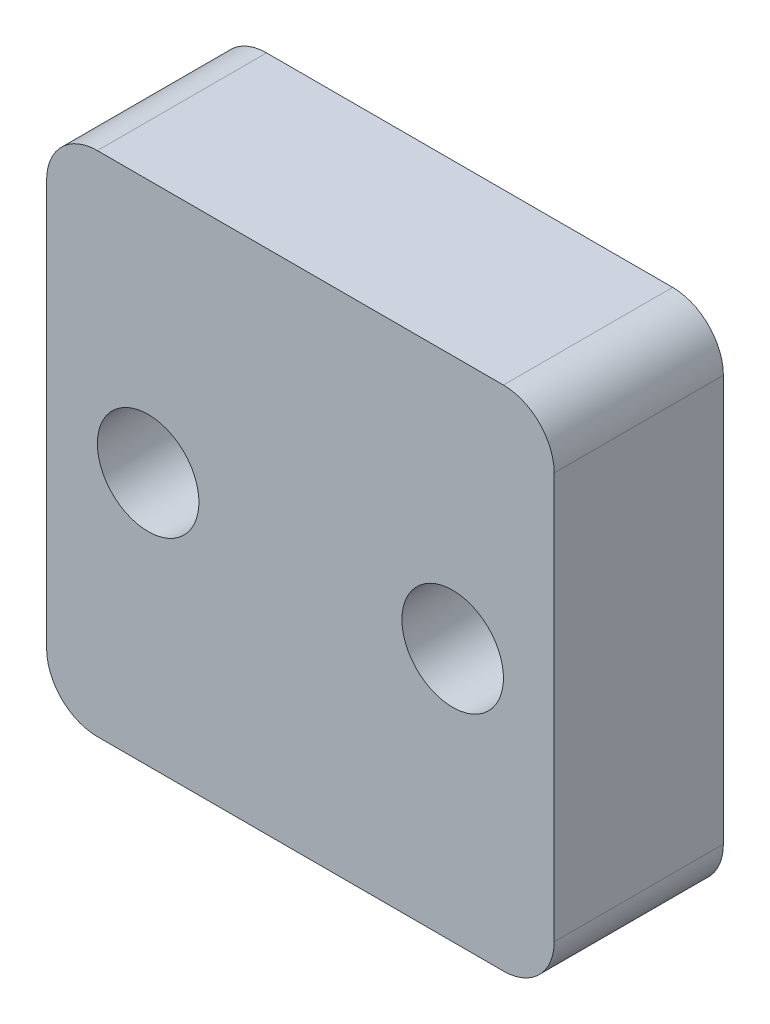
ISO-10303-21;
HEADER;
FILE_DESCRIPTION(('STEP AP214'),'2;1');
FILE_NAME('part.step','',(''),(''),'','','');
FILE_SCHEMA(('AUTOMOTIVE_DESIGN { 1 0 10303 214 1 1 1 1 }'));
ENDSEC;
DATA;
#1=APPLICATION_CONTEXT('core data for automotive mechanical design processes');
#2=APPLICATION_PROTOCOL_DEFINITION('international standard','automotive_design',2000,#1);
#3=PRODUCT_CONTEXT('',#1,'mechanical');
#4=PRODUCT('Part','Part','',(#3));
#5=PRODUCT_RELATED_PRODUCT_CATEGORY('part','',(#4));
#6=PRODUCT_DEFINITION_FORMATION('','',#4);
#7=PRODUCT_DEFINITION_CONTEXT('part definition',#1,'design');
#8=PRODUCT_DEFINITION('design','',#6,#7);
#9=PRODUCT_DEFINITION_SHAPE('','',#8);
#10=(LENGTH_UNIT() NAMED_UNIT(*) SI_UNIT(.MILLI.,.METRE.));
#11=(NAMED_UNIT(*) PLANE_ANGLE_UNIT() SI_UNIT($,.RADIAN.));
#12=(NAMED_UNIT(*) SI_UNIT($,.STERADIAN.) SOLID_ANGLE_UNIT());
#13=UNCERTAINTY_MEASURE_WITH_UNIT(LENGTH_MEASURE(1.E-05),#10,'distance_accuracy_value','');
#14=(GEOMETRIC_REPRESENTATION_CONTEXT(3) GLOBAL_UNCERTAINTY_ASSIGNED_CONTEXT((#13)) GLOBAL_UNIT_ASSIGNED_CONTEXT((#10,
#11,#12)) REPRESENTATION_CONTEXT('',''));
#15=CARTESIAN_POINT('',(0.,0.,0.));
#16=DIRECTION('',(0.,0.,1.));
#17=DIRECTION('',(1.,0.,0.));
#18=AXIS2_PLACEMENT_3D('',#15,#16,#17);
#19=CARTESIAN_POINT('',(-15.,-15.,0.));
#20=DIRECTION('',(0.,0.,1.));
#21=DIRECTION('',(1.,0.,0.));
#22=AXIS2_PLACEMENT_3D('',#19,#20,#21);
#23=PLANE('',#22);
#24=CARTESIAN_POINT('',(9.00000000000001,0.,0.));
#25=DIRECTION('',(0.,0.,-1.));
#26=DIRECTION('',(-1.,0.,0.));
#27=AXIS2_PLACEMENT_3D('',#24,#25,#26);
#28=CIRCLE('',#27,3.);
#29=CARTESIAN_POINT('',(6.,0.,0.));
#30=VERTEX_POINT('',#29);
#31=EDGE_CURVE('E134',#30,#30,#28,.F.);
#32=ORIENTED_EDGE('',*,*,#31,.T.);
#33=EDGE_LOOP('',(#32));
#34=FACE_BOUND('',#33,.T.);
#35=CARTESIAN_POINT('',(12.,12.,0.));
#36=DIRECTION('',(0.,0.,-1.));
#37=DIRECTION('',(-1.,0.,0.));
#38=AXIS2_PLACEMENT_3D('',#35,#36,#37);
#39=CIRCLE('',#38,3.);
#40=CARTESIAN_POINT('',(15.,12.,0.));
#41=VERTEX_POINT('',#40);
#42=CARTESIAN_POINT('',(12.,15.,0.));
#43=VERTEX_POINT('',#42);
#44=EDGE_CURVE('E85',#41,#43,#39,.F.);
#45=ORIENTED_EDGE('',*,*,#44,.F.);
#46=DIRECTION('',(0.,-1.,0.));
#47=VECTOR('',#46,1.);
#48=CARTESIAN_POINT('',(15.,15.,0.));
#49=LINE('',#48,#47);
#50=CARTESIAN_POINT('',(15.,-12.,0.));
#51=VERTEX_POINT('',#50);
#52=EDGE_CURVE('E77',#41,#51,#49,.T.);
#53=ORIENTED_EDGE('',*,*,#52,.T.);
#54=CARTESIAN_POINT('',(12.,-12.,0.));
#55=DIRECTION('',(0.,0.,-1.));
#56=DIRECTION('',(-1.,0.,0.));
#57=AXIS2_PLACEMENT_3D('',#54,#55,#56);
#58=CIRCLE('',#57,3.);
#59=CARTESIAN_POINT('',(12.,-15.,0.));
#60=VERTEX_POINT('',#59);
#61=EDGE_CURVE('E138',#60,#51,#58,.F.);
#62=ORIENTED_EDGE('',*,*,#61,.F.);
#63=DIRECTION('',(-1.,0.,0.));
#64=VECTOR('',#63,1.);
#65=CARTESIAN_POINT('',(-15.,-15.,0.));
#66=LINE('',#65,#64);
#67=CARTESIAN_POINT('',(-12.,-15.,0.));
#68=VERTEX_POINT('',#67);
#69=EDGE_CURVE('E110',#60,#68,#66,.T.);
#70=ORIENTED_EDGE('',*,*,#69,.T.);
#71=CARTESIAN_POINT('',(-12.,-12.,0.));
#72=DIRECTION('',(0.,0.,-1.));
#73=DIRECTION('',(-1.,0.,0.));
#74=AXIS2_PLACEMENT_3D('',#71,#72,#73);
#75=CIRCLE('',#74,3.);
#76=CARTESIAN_POINT('',(-15.,-12.,0.));
#77=VERTEX_POINT('',#76);
#78=EDGE_CURVE('E141',#77,#68,#75,.F.);
#79=ORIENTED_EDGE('',*,*,#78,.F.);
#80=DIRECTION('',(0.,1.,0.));
#81=VECTOR('',#80,1.);
#82=CARTESIAN_POINT('',(-15.,15.,0.));
#83=LINE('',#82,#81);
#84=CARTESIAN_POINT('',(-15.,12.,0.));
#85=VERTEX_POINT('',#84);
#86=EDGE_CURVE('E114',#77,#85,#83,.T.);
#87=ORIENTED_EDGE('',*,*,#86,.T.);
#88=CARTESIAN_POINT('',(-12.,12.,0.));
#89=DIRECTION('',(0.,0.,-1.));
#90=DIRECTION('',(-1.,0.,0.));
#91=AXIS2_PLACEMENT_3D('',#88,#89,#90);
#92=CIRCLE('',#91,3.);
#93=CARTESIAN_POINT('',(-12.,15.,0.));
#94=VERTEX_POINT('',#93);
#95=EDGE_CURVE('E88',#94,#85,#92,.F.);
#96=ORIENTED_EDGE('',*,*,#95,.F.);
#97=DIRECTION('',(1.,0.,0.));
#98=VECTOR('',#97,1.);
#99=CARTESIAN_POINT('',(-15.,15.,0.));
#100=LINE('',#99,#98);
#101=EDGE_CURVE('E82',#94,#43,#100,.T.);
#102=ORIENTED_EDGE('',*,*,#101,.T.);
#103=EDGE_LOOP('',(#45,#53,#62,#70,#79,#87,#96,#102));
#104=FACE_BOUND('',#103,.T.);
#105=CARTESIAN_POINT('',(-8.99999999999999,0.,0.));
#106=DIRECTION('',(0.,0.,-1.));
#107=DIRECTION('',(-1.,0.,0.));
#108=AXIS2_PLACEMENT_3D('',#105,#106,#107);
#109=CIRCLE('',#108,3.);
#110=CARTESIAN_POINT('',(-12.,0.,0.));
#111=VERTEX_POINT('',#110);
#112=EDGE_CURVE('E19',#111,#111,#109,.F.);
#113=ORIENTED_EDGE('',*,*,#112,.T.);
#114=EDGE_LOOP('',(#113));
#115=FACE_BOUND('',#114,.T.);
#116=ADVANCED_FACE('F16',(#34,#104,#115),#23,.F.);
#117=CARTESIAN_POINT('',(-8.99999999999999,0.,10.));
#118=DIRECTION('',(0.,0.,-1.));
#119=DIRECTION('',(-1.,0.,0.));
#120=AXIS2_PLACEMENT_3D('',#117,#118,#119);
#121=CYLINDRICAL_SURFACE('',#120,3.);
#122=CARTESIAN_POINT('',(-8.99999999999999,0.,10.));
#123=DIRECTION('',(0.,0.,-1.));
#124=DIRECTION('',(-1.,0.,0.));
#125=AXIS2_PLACEMENT_3D('',#122,#123,#124);
#126=CIRCLE('',#125,3.);
#127=CARTESIAN_POINT('',(-12.,0.,10.));
#128=VERTEX_POINT('',#127);
#129=EDGE_CURVE('E131',#128,#128,#126,.T.);
#130=ORIENTED_EDGE('',*,*,#129,.F.);
#131=EDGE_LOOP('',(#130));
#132=FACE_BOUND('',#131,.T.);
#133=ORIENTED_EDGE('',*,*,#112,.F.);
#134=EDGE_LOOP('',(#133));
#135=FACE_BOUND('',#134,.T.);
#136=ADVANCED_FACE('F263',(#132,#135),#121,.F.);
#137=CARTESIAN_POINT('',(15.,15.,10.));
#138=DIRECTION('',(-1.,0.,0.));
#139=DIRECTION('',(0.,-1.,0.));
#140=AXIS2_PLACEMENT_3D('',#137,#138,#139);
#141=PLANE('',#140);
#142=DIRECTION('',(0.,0.,-1.));
#143=VECTOR('',#142,1.);
#144=CARTESIAN_POINT('',(15.,12.,10.));
#145=LINE('',#144,#143);
#146=CARTESIAN_POINT('',(15.,12.,10.));
#147=VERTEX_POINT('',#146);
#148=EDGE_CURVE('E98',#147,#41,#145,.T.);
#149=ORIENTED_EDGE('',*,*,#148,.F.);
#150=DIRECTION('',(0.,1.,0.));
#151=VECTOR('',#150,1.);
#152=CARTESIAN_POINT('',(15.,-15.,10.));
#153=LINE('',#152,#151);
#154=CARTESIAN_POINT('',(15.,-12.,10.));
#155=VERTEX_POINT('',#154);
#156=EDGE_CURVE('E130',#155,#147,#153,.T.);
#157=ORIENTED_EDGE('',*,*,#156,.F.);
#158=DIRECTION('',(0.,0.,-1.));
#159=VECTOR('',#158,1.);
#160=CARTESIAN_POINT('',(15.,-12.,10.));
#161=LINE('',#160,#159);
#162=EDGE_CURVE('E137',#51,#155,#161,.F.);
#163=ORIENTED_EDGE('',*,*,#162,.F.);
#164=ORIENTED_EDGE('',*,*,#52,.F.);
#165=EDGE_LOOP('',(#149,#157,#163,#164));
#166=FACE_BOUND('',#165,.T.);
#167=ADVANCED_FACE('F172',(#166),#141,.F.);
#168=CARTESIAN_POINT('',(12.,12.,10.));
#169=DIRECTION('',(0.,0.,-1.));
#170=DIRECTION('',(-1.,0.,0.));
#171=AXIS2_PLACEMENT_3D('',#168,#169,#170);
#172=CYLINDRICAL_SURFACE('',#171,3.);
#173=ORIENTED_EDGE('',*,*,#44,.T.);
#174=DIRECTION('',(0.,0.,1.));
#175=VECTOR('',#174,1.);
#176=CARTESIAN_POINT('',(12.,15.,10.));
#177=LINE('',#176,#175);
#178=CARTESIAN_POINT('',(12.,15.,10.));
#179=VERTEX_POINT('',#178);
#180=EDGE_CURVE('E92',#43,#179,#177,.T.);
#181=ORIENTED_EDGE('',*,*,#180,.T.);
#182=CARTESIAN_POINT('',(12.,12.,10.));
#183=DIRECTION('',(0.,0.,-1.));
#184=DIRECTION('',(-1.,0.,0.));
#185=AXIS2_PLACEMENT_3D('',#182,#183,#184);
#186=CIRCLE('',#185,3.);
#187=EDGE_CURVE('E128',#147,#179,#186,.F.);
#188=ORIENTED_EDGE('',*,*,#187,.F.);
#189=ORIENTED_EDGE('',*,*,#148,.T.);
#190=EDGE_LOOP('',(#173,#181,#188,#189));
#191=FACE_BOUND('',#190,.T.);
#192=ADVANCED_FACE('F95',(#191),#172,.T.);
#193=CARTESIAN_POINT('',(-15.,15.,10.));
#194=DIRECTION('',(0.,-1.,0.));
#195=DIRECTION('',(1.,0.,0.));
#196=AXIS2_PLACEMENT_3D('',#193,#194,#195);
#197=PLANE('',#196);
#198=ORIENTED_EDGE('',*,*,#180,.F.);
#199=ORIENTED_EDGE('',*,*,#101,.F.);
#200=DIRECTION('',(0.,0.,-1.));
#201=VECTOR('',#200,1.);
#202=CARTESIAN_POINT('',(-12.,15.,10.));
#203=LINE('',#202,#201);
#204=CARTESIAN_POINT('',(-12.,15.,10.));
#205=VERTEX_POINT('',#204);
#206=EDGE_CURVE('E103',#205,#94,#203,.T.);
#207=ORIENTED_EDGE('',*,*,#206,.F.);
#208=DIRECTION('',(1.,0.,0.));
#209=VECTOR('',#208,1.);
#210=CARTESIAN_POINT('',(-15.,15.,10.));
#211=LINE('',#210,#209);
#212=EDGE_CURVE('E101',#179,#205,#211,.F.);
#213=ORIENTED_EDGE('',*,*,#212,.F.);
#214=EDGE_LOOP('',(#198,#199,#207,#213));
#215=FACE_BOUND('',#214,.T.);
#216=ADVANCED_FACE('F99',(#215),#197,.F.);
#217=CARTESIAN_POINT('',(-12.,12.,10.));
#218=DIRECTION('',(0.,0.,-1.));
#219=DIRECTION('',(-1.,0.,0.));
#220=AXIS2_PLACEMENT_3D('',#217,#218,#219);
#221=CYLINDRICAL_SURFACE('',#220,3.);
#222=ORIENTED_EDGE('',*,*,#95,.T.);
#223=DIRECTION('',(0.,0.,1.));
#224=VECTOR('',#223,1.);
#225=CARTESIAN_POINT('',(-15.,12.,10.));
#226=LINE('',#225,#224);
#227=CARTESIAN_POINT('',(-15.,12.,10.));
#228=VERTEX_POINT('',#227);
#229=EDGE_CURVE('E116',#85,#228,#226,.T.);
#230=ORIENTED_EDGE('',*,*,#229,.T.);
#231=CARTESIAN_POINT('',(-12.,12.,10.));
#232=DIRECTION('',(0.,0.,-1.));
#233=DIRECTION('',(-1.,0.,0.));
#234=AXIS2_PLACEMENT_3D('',#231,#232,#233);
#235=CIRCLE('',#234,3.);
#236=EDGE_CURVE('E125',#205,#228,#235,.F.);
#237=ORIENTED_EDGE('',*,*,#236,.F.);
#238=ORIENTED_EDGE('',*,*,#206,.T.);
#239=EDGE_LOOP('',(#222,#230,#237,#238));
#240=FACE_BOUND('',#239,.T.);
#241=ADVANCED_FACE('F173',(#240),#221,.T.);
#242=CARTESIAN_POINT('',(-15.,15.,10.));
#243=DIRECTION('',(1.,0.,0.));
#244=DIRECTION('',(0.,1.,0.));
#245=AXIS2_PLACEMENT_3D('',#242,#243,#244);
#246=PLANE('',#245);
#247=DIRECTION('',(0.,0.,-1.));
#248=VECTOR('',#247,1.);
#249=CARTESIAN_POINT('',(-15.,-12.,10.));
#250=LINE('',#249,#248);
#251=CARTESIAN_POINT('',(-15.,-12.,10.));
#252=VERTEX_POINT('',#251);
#253=EDGE_CURVE('E115',#252,#77,#250,.T.);
#254=ORIENTED_EDGE('',*,*,#253,.F.);
#255=DIRECTION('',(0.,1.,0.));
#256=VECTOR('',#255,1.);
#257=CARTESIAN_POINT('',(-15.,-15.,10.));
#258=LINE('',#257,#256);
#259=EDGE_CURVE('E124',#228,#252,#258,.F.);
#260=ORIENTED_EDGE('',*,*,#259,.F.);
#261=ORIENTED_EDGE('',*,*,#229,.F.);
#262=ORIENTED_EDGE('',*,*,#86,.F.);
#263=EDGE_LOOP('',(#254,#260,#261,#262));
#264=FACE_BOUND('',#263,.T.);
#265=ADVANCED_FACE('F175',(#264),#246,.F.);
#266=CARTESIAN_POINT('',(-12.,-12.,10.));
#267=DIRECTION('',(0.,0.,-1.));
#268=DIRECTION('',(-1.,0.,0.));
#269=AXIS2_PLACEMENT_3D('',#266,#267,#268);
#270=CYLINDRICAL_SURFACE('',#269,3.);
#271=ORIENTED_EDGE('',*,*,#78,.T.);
#272=DIRECTION('',(0.,0.,1.));
#273=VECTOR('',#272,1.);
#274=CARTESIAN_POINT('',(-12.,-15.,10.));
#275=LINE('',#274,#273);
#276=CARTESIAN_POINT('',(-12.,-15.,10.));
#277=VERTEX_POINT('',#276);
#278=EDGE_CURVE('E113',#68,#277,#275,.T.);
#279=ORIENTED_EDGE('',*,*,#278,.T.);
#280=CARTESIAN_POINT('',(-12.,-12.,10.));
#281=DIRECTION('',(0.,0.,-1.));
#282=DIRECTION('',(-1.,0.,0.));
#283=AXIS2_PLACEMENT_3D('',#280,#281,#282);
#284=CIRCLE('',#283,3.);
#285=EDGE_CURVE('E121',#252,#277,#284,.F.);
#286=ORIENTED_EDGE('',*,*,#285,.F.);
#287=ORIENTED_EDGE('',*,*,#253,.T.);
#288=EDGE_LOOP('',(#271,#279,#286,#287));
#289=FACE_BOUND('',#288,.T.);
#290=ADVANCED_FACE('F168',(#289),#270,.T.);
#291=CARTESIAN_POINT('',(-15.,-15.,10.));
#292=DIRECTION('',(0.,1.,0.));
#293=DIRECTION('',(-1.,0.,0.));
#294=AXIS2_PLACEMENT_3D('',#291,#292,#293);
#295=PLANE('',#294);
#296=DIRECTION('',(0.,0.,-1.));
#297=VECTOR('',#296,1.);
#298=CARTESIAN_POINT('',(12.,-15.,10.));
#299=LINE('',#298,#297);
#300=CARTESIAN_POINT('',(12.,-15.,10.));
#301=VERTEX_POINT('',#300);
#302=EDGE_CURVE('E34',#301,#60,#299,.T.);
#303=ORIENTED_EDGE('',*,*,#302,.F.);
#304=DIRECTION('',(1.,0.,0.));
#305=VECTOR('',#304,1.);
#306=CARTESIAN_POINT('',(-15.,-15.,10.));
#307=LINE('',#306,#305);
#308=EDGE_CURVE('E120',#277,#301,#307,.T.);
#309=ORIENTED_EDGE('',*,*,#308,.F.);
#310=ORIENTED_EDGE('',*,*,#278,.F.);
#311=ORIENTED_EDGE('',*,*,#69,.F.);
#312=EDGE_LOOP('',(#303,#309,#310,#311));
#313=FACE_BOUND('',#312,.T.);
#314=ADVANCED_FACE('F165',(#313),#295,.F.);
#315=CARTESIAN_POINT('',(12.,-12.,10.));
#316=DIRECTION('',(0.,0.,-1.));
#317=DIRECTION('',(-1.,0.,0.));
#318=AXIS2_PLACEMENT_3D('',#315,#316,#317);
#319=CYLINDRICAL_SURFACE('',#318,3.);
#320=ORIENTED_EDGE('',*,*,#61,.T.);
#321=ORIENTED_EDGE('',*,*,#162,.T.);
#322=CARTESIAN_POINT('',(12.,-12.,10.));
#323=DIRECTION('',(0.,0.,-1.));
#324=DIRECTION('',(-1.,0.,0.));
#325=AXIS2_PLACEMENT_3D('',#322,#323,#324);
#326=CIRCLE('',#325,3.);
#327=EDGE_CURVE('E25',#301,#155,#326,.F.);
#328=ORIENTED_EDGE('',*,*,#327,.F.);
#329=ORIENTED_EDGE('',*,*,#302,.T.);
#330=EDGE_LOOP('',(#320,#321,#328,#329));
#331=FACE_BOUND('',#330,.T.);
#332=ADVANCED_FACE('F171',(#331),#319,.T.);
#333=CARTESIAN_POINT('',(9.00000000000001,0.,10.));
#334=DIRECTION('',(0.,0.,-1.));
#335=DIRECTION('',(-1.,0.,0.));
#336=AXIS2_PLACEMENT_3D('',#333,#334,#335);
#337=CYLINDRICAL_SURFACE('',#336,3.);
#338=CARTESIAN_POINT('',(9.00000000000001,0.,10.));
#339=DIRECTION('',(0.,0.,-1.));
#340=DIRECTION('',(-1.,0.,0.));
#341=AXIS2_PLACEMENT_3D('',#338,#339,#340);
#342=CIRCLE('',#341,3.);
#343=CARTESIAN_POINT('',(6.,0.,10.));
#344=VERTEX_POINT('',#343);
#345=EDGE_CURVE('E11',#344,#344,#342,.T.);
#346=ORIENTED_EDGE('',*,*,#345,.F.);
#347=EDGE_LOOP('',(#346));
#348=FACE_BOUND('',#347,.T.);
#349=ORIENTED_EDGE('',*,*,#31,.F.);
#350=EDGE_LOOP('',(#349));
#351=FACE_BOUND('',#350,.T.);
#352=ADVANCED_FACE('F186',(#348,#351),#337,.F.);
#353=CARTESIAN_POINT('',(-15.,-15.,10.));
#354=DIRECTION('',(0.,0.,1.));
#355=DIRECTION('',(1.,0.,0.));
#356=AXIS2_PLACEMENT_3D('',#353,#354,#355);
#357=PLANE('',#356);
#358=ORIENTED_EDGE('',*,*,#345,.T.);
#359=EDGE_LOOP('',(#358));
#360=FACE_BOUND('',#359,.T.);
#361=ORIENTED_EDGE('',*,*,#308,.T.);
#362=ORIENTED_EDGE('',*,*,#327,.T.);
#363=ORIENTED_EDGE('',*,*,#156,.T.);
#364=ORIENTED_EDGE('',*,*,#187,.T.);
#365=ORIENTED_EDGE('',*,*,#212,.T.);
#366=ORIENTED_EDGE('',*,*,#236,.T.);
#367=ORIENTED_EDGE('',*,*,#259,.T.);
#368=ORIENTED_EDGE('',*,*,#285,.T.);
#369=EDGE_LOOP('',(#361,#362,#363,#364,#365,#366,#367,#368));
#370=FACE_BOUND('',#369,.T.);
#371=ORIENTED_EDGE('',*,*,#129,.T.);
#372=EDGE_LOOP('',(#371));
#373=FACE_BOUND('',#372,.T.);
#374=ADVANCED_FACE('F161',(#360,#370,#373),#357,.T.);
#375=CLOSED_SHELL('',(#116,#136,#167,#192,#216,#241,#265,#290,#314,#332,#352,#374));
#376=MANIFOLD_SOLID_BREP('B1',#375);
#377=ADVANCED_BREP_SHAPE_REPRESENTATION('',(#18,#376),#14);
#378=SHAPE_DEFINITION_REPRESENTATION(#9,#377);
ENDSEC;
END-ISO-10303-21;
